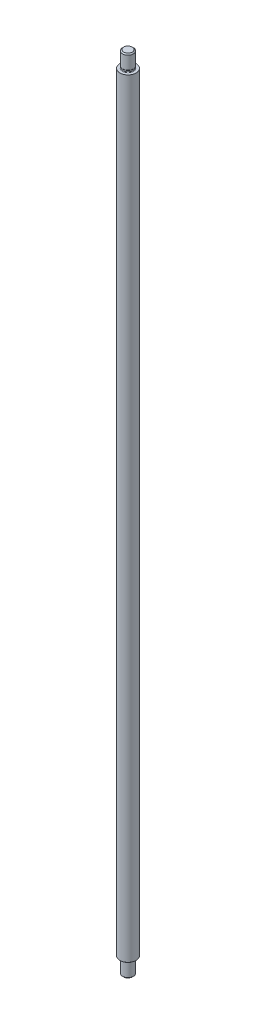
from build123d import *


with BuildPart() as part:
    # Sketch 1 → Revolve 1 (revolve)
    with BuildSketch(Plane(origin=(0, 0, 0), x_dir=(-1, 0, 0), z_dir=(0, 0, -1)), mode=Mode.PRIVATE) as revolve_1_sk:
        with BuildLine():
            Line((-4, -140), (0, -140))
            Line((0, -140), (0, 600))
            Line((0, 600), (-4, 600))
            Line((-4, 600), (-5, 599))
            Line((-5, 599), (-5, 587))
            Line((-5, 587), (-4.687867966, 586.687867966))
            ThreePointArc((-4.687867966, 586.687867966), (-4.62283614, 586.590540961), (-4.6, 586.475735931))
            Line((-4.6, 586.475735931), (-4.6, 585.5))
            ThreePointArc((-4.6, 585.5), (-4.746446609, 585.146446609), (-5.1, 585))
            Line((-5.1, 585), (-7.5, 585))
            Line((-7.5, 585), (-7.5, -125))
            Line((-7.5, -125), (-5.1, -125))
            ThreePointArc((-5.1, -125), (-4.746446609, -125.146446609), (-4.6, -125.5))
            Line((-4.6, -125.5), (-4.6, -126.475735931))
            ThreePointArc((-4.6, -126.475735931), (-4.62283614, -126.590540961), (-4.687867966, -126.687867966))
            Line((-4.687867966, -126.687867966), (-5, -127))
            Line((-5, -127), (-5, -139))
            Line((-5, -139), (-4, -140))
        make_face()
    revolve(revolve_1_sk.sketch.rotate(Axis((0, -140, 0), (0, 1, 0)), 270), axis=Axis((0, -140, 0), (0, 1, 0)))


solid = part.part
